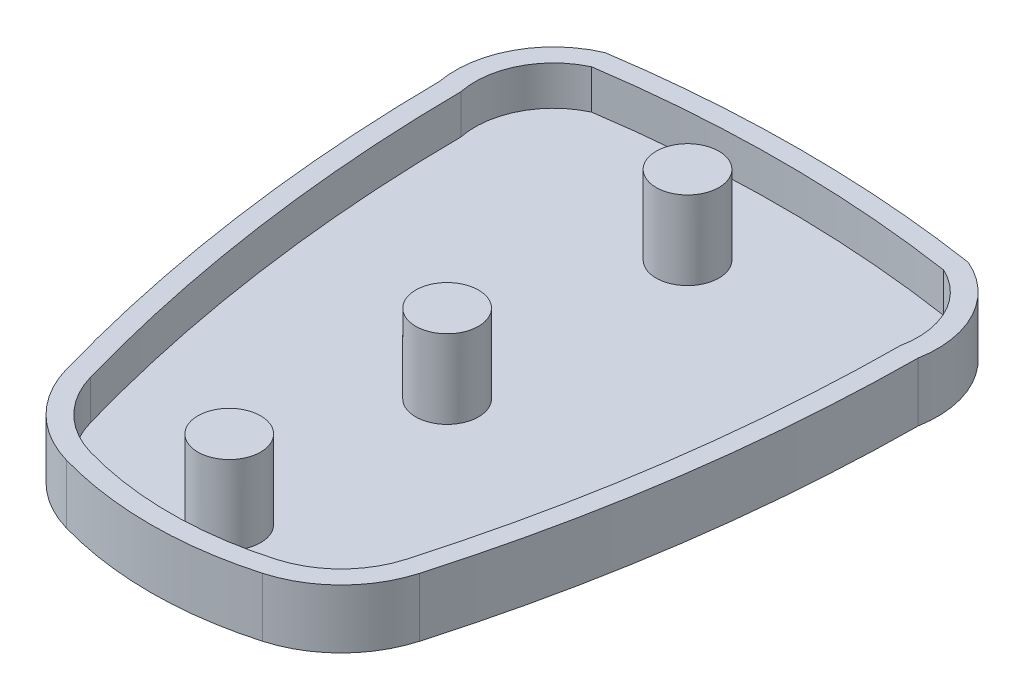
from build123d import *

# Parameters (mm, degrees)
BOSS_EXTRUDE1_DEPTH = 2
BOSS_EXTRUDE2_START = 1
BOSS_EXTRUDE2_DEPTH = 1
SKETCH3_R           = 1.6
BOSS_EXTRUDE3_DEPTH = 4
SKETCH6_R           = 3.2
SKETCH6_R_2         = 2
SKETCH6_W           = 22
SKETCH6_H           = 1.2
SKETCH6_W_2         = 17
CUT_EXTRUDE3_DEPTH  = 0.5
CUT_EXTRUDE4_DEPTH  = 0.5


with BuildPart() as part:
    # Sketch1 → Boss-Extrude1 (new body)
    with BuildSketch(Plane(origin=(0, 0, 0), x_dir=(1, 0, 0), z_dir=(0, 1, 0))):
        with BuildLine():
            ThreePointArc((-12.2, -5.5), (-11.688509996, -2.233208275), (-9.25, 0))
            ThreePointArc((-9.25, 0), (0, 0.7), (9.25, 0))
            ThreePointArc((9.25, 0), (11.688509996, -2.233208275), (12.2, -5.5))
            ThreePointArc((12.2, -5.5), (11.350578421, -16.708191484), (9, -27.7))
            ThreePointArc((9, -27.7), (7.518367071, -30.218367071), (5, -31.7))
            ThreePointArc((5, -31.7), (0, -32.4), (-5, -31.7))
            ThreePointArc((-5, -31.7), (-7.518367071, -30.218367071), (-9, -27.7))
            ThreePointArc((-9, -27.7), (-11.350578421, -16.708191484), (-12.2, -5.5))
        make_face()
        with BuildLine():
            ThreePointArc((-11.200726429, -5.400246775), (-10.854193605, -2.796097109), (-8.966907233, -0.96857676))
            ThreePointArc((-8.966907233, -0.96857676), (0, -0.3), (8.966907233, -0.96857676))
            ThreePointArc((8.966907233, -0.96857676), (10.854193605, -2.796097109), (11.200726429, -5.400246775))
            ThreePointArc((11.200726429, -5.400246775), (10.367331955, -16.520172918), (8.03844645, -27.425382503))
            ThreePointArc((8.03844645, -27.425382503), (6.81126029, -29.51126029), (4.725382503, -30.73844645))
            ThreePointArc((4.725382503, -30.73844645), (0, -31.4), (-4.725382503, -30.73844645))
            ThreePointArc((-4.725382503, -30.73844645), (-6.81126029, -29.51126029), (-8.03844645, -27.425382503))
            ThreePointArc((-8.03844645, -27.425382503), (-10.367331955, -16.520172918), (-11.200726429, -5.400246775))
        make_face(mode=Mode.SUBTRACT)
    extrude(amount=BOSS_EXTRUDE1_DEPTH)

    # Sketch2 → Boss-Extrude2 (add)
    with BuildSketch(Plane.XZ.offset(BOSS_EXTRUDE2_START)):
        with BuildLine():
            ThreePointArc((-12.2, 5.5), (-11.688509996, 2.233208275), (-9.25, 0))
            ThreePointArc((-9.25, 0), (0, -0.7), (9.25, 0))
            ThreePointArc((9.25, 0), (11.688509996, 2.233208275), (12.2, 5.5))
            ThreePointArc((12.2, 5.5), (11.350578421, 16.708191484), (9, 27.7))
            ThreePointArc((9, 27.7), (7.518367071, 30.218367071), (5, 31.7))
            ThreePointArc((5, 31.7), (0, 32.4), (-5, 31.7))
            ThreePointArc((-5, 31.7), (-7.518367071, 30.218367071), (-9, 27.7))
            ThreePointArc((-9, 27.7), (-11.350578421, 16.708191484), (-12.2, 5.5))
        make_face()
    extrude(amount=-BOSS_EXTRUDE2_DEPTH)

    # Sketch3 → Boss-Extrude3 (add)
    with BuildSketch(Plane(origin=(0, 0, 0), x_dir=(1, 0, 0), z_dir=(0, 1, 0))):
        with Locations(Location((0, -5.05, 0), (0, 0, 90))):
            Circle(SKETCH3_R)
        with Locations(Location((0, -17.3, 0), (0, 0, 90))):
            Circle(SKETCH3_R)
        with Locations(Location((0, -28.4, 0), (0, 0, 90))):
            Circle(SKETCH3_R)
    extrude(amount=BOSS_EXTRUDE3_DEPTH)

    # Sketch6 → Cut-Extrude3 (cut)
    # profile 1 of 5: a face of its own
    with BuildSketch(Plane(origin=(0, -1, 0), x_dir=(-1, 0, 0), z_dir=(0, -1, 0))):
        with Locations(Location((0, -6.05, 0), (0, 0, 90))):
            Circle(SKETCH6_R)
        with Locations(Location((0, -6.05, 0), (0, 0, 90))):
            Circle(SKETCH6_R_2, mode=Mode.SUBTRACT)
    # profile 2 of 5: a face of its own
    with BuildSketch(Plane(origin=(0, -1, 0), x_dir=(-1, 0, 0), z_dir=(0, -1, 0))):
        with Locations((0, -11.175)):
            Rectangle(SKETCH6_W, SKETCH6_H)
    # profile 3 of 5: a face of its own
    with BuildSketch(Plane(origin=(0, -1, 0), x_dir=(-1, 0, 0), z_dir=(0, -1, 0))):
        with Locations((0, -22.85)):
            Rectangle(SKETCH6_W_2, SKETCH6_H)
    # profile 4 of 5: a face of its own
    with BuildSketch(Plane(origin=(0, -1, 0), x_dir=(-1, 0, 0), z_dir=(0, -1, 0))):
        with BuildLine():
            Line((1.7, -19.1), (4.528427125, -16.271572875))
            ThreePointArc((4.528427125, -16.271572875), (4.528427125, -15.423044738), (3.679898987, -15.423044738))
            Line((3.679898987, -15.423044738), (1.202943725, -17.9))
            Line((1.202943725, -17.9), (-4.3, -17.9))
            ThreePointArc((-4.3, -17.9), (-4.9, -18.5), (-4.3, -19.1))
            Line((-4.3, -19.1), (1.7, -19.1))
        make_face()
    # profile 5 of 5: a face of its own
    with BuildSketch(Plane(origin=(0, -1, 0), x_dir=(-1, 0, 0), z_dir=(0, -1, 0))):
        with BuildLine():
            ThreePointArc((-1.414213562, -24.985786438), (-1.902773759, -27.01599677), (-0.317098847, -28.374702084))
            ThreePointArc((-0.317098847, -28.374702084), (1.781039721, -27.309888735), (1.414213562, -24.985786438))
            ThreePointArc((1.414213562, -24.985786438), (1.414213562, -24.1372583), (2.2627417, -24.1372583))
            ThreePointArc((2.2627417, -24.1372583), (2.849663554, -27.855821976), (-0.507358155, -29.559523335))
            ThreePointArc((-0.507358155, -29.559523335), (-3.044438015, -27.385594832), (-2.2627417, -24.1372583))
            ThreePointArc((-2.2627417, -24.1372583), (-1.414213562, -24.1372583), (-1.414213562, -24.985786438))
        make_face()
    extrude(amount=-CUT_EXTRUDE3_DEPTH, mode=Mode.SUBTRACT)

    # Sketch7 → Cut-Extrude4 (cut)
    with BuildSketch(Plane.XZ.offset(1)):
        with BuildLine():
            ThreePointArc((-11.200726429, 5.400246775), (-10.854193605, 2.796097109), (-8.966907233, 0.96857676))
            ThreePointArc((-8.966907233, 0.96857676), (0, 0.3), (8.966907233, 0.96857676))
            ThreePointArc((8.966907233, 0.96857676), (10.854193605, 2.796097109), (11.200726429, 5.400246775))
            ThreePointArc((11.200726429, 5.400246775), (10.367331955, 16.520172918), (8.03844645, 27.425382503))
            ThreePointArc((8.03844645, 27.425382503), (6.81126029, 29.51126029), (4.725382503, 30.73844645))
            ThreePointArc((4.725382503, 30.73844645), (0, 31.4), (-4.725382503, 30.73844645))
            ThreePointArc((-4.725382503, 30.73844645), (-6.81126029, 29.51126029), (-8.03844645, 27.425382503))
            ThreePointArc((-8.03844645, 27.425382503), (-10.367331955, 16.520172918), (-11.200726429, 5.400246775))
        make_face()
        with BuildLine():
            ThreePointArc((-4.450765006, 29.776892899), (-6.104153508, 28.804153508), (-7.076892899, 27.150765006))
            ThreePointArc((-7.076892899, 27.150765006), (-9.384910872, 16.326196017), (-10.201418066, 5.2884627))
            ThreePointArc((-10.201418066, 5.2884627), (-10.010112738, 3.347920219), (-8.666366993, 1.934891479))
            ThreePointArc((-8.666366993, 1.934891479), (0, 1.3), (8.666366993, 1.934891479))
            ThreePointArc((8.666366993, 1.934891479), (10.010112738, 3.347920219), (10.201418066, 5.2884627))
            ThreePointArc((10.201418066, 5.2884627), (9.384910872, 16.326196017), (7.076892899, 27.150765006))
            ThreePointArc((7.076892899, 27.150765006), (6.104153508, 28.804153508), (4.450765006, 29.776892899))
            ThreePointArc((4.450765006, 29.776892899), (0, 30.4), (-4.450765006, 29.776892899))
        make_face(mode=Mode.SUBTRACT)
    extrude(amount=-CUT_EXTRUDE4_DEPTH, mode=Mode.SUBTRACT)


solid = part.part
